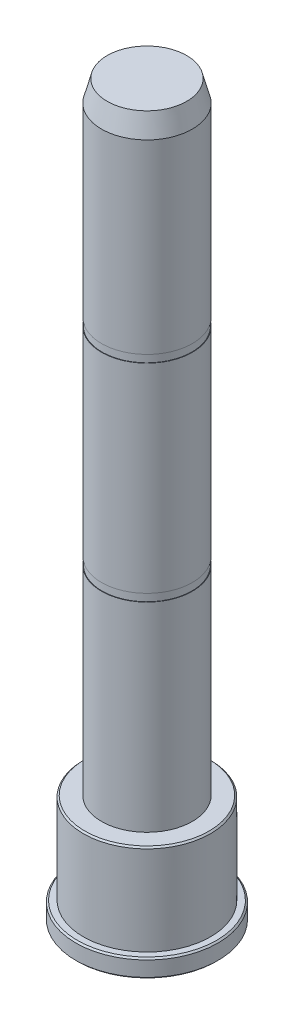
ISO-10303-21;
HEADER;
FILE_DESCRIPTION(('STEP AP214'),'2;1');
FILE_NAME('part.step','',(''),(''),'','','');
FILE_SCHEMA(('AUTOMOTIVE_DESIGN { 1 0 10303 214 1 1 1 1 }'));
ENDSEC;
DATA;
#1=APPLICATION_CONTEXT('core data for automotive mechanical design processes');
#2=APPLICATION_PROTOCOL_DEFINITION('international standard','automotive_design',2000,#1);
#3=PRODUCT_CONTEXT('',#1,'mechanical');
#4=PRODUCT('Part','Part','',(#3));
#5=PRODUCT_RELATED_PRODUCT_CATEGORY('part','',(#4));
#6=PRODUCT_DEFINITION_FORMATION('','',#4);
#7=PRODUCT_DEFINITION_CONTEXT('part definition',#1,'design');
#8=PRODUCT_DEFINITION('design','',#6,#7);
#9=PRODUCT_DEFINITION_SHAPE('','',#8);
#10=(LENGTH_UNIT() NAMED_UNIT(*) SI_UNIT(.MILLI.,.METRE.));
#11=(NAMED_UNIT(*) PLANE_ANGLE_UNIT() SI_UNIT($,.RADIAN.));
#12=(NAMED_UNIT(*) SI_UNIT($,.STERADIAN.) SOLID_ANGLE_UNIT());
#13=UNCERTAINTY_MEASURE_WITH_UNIT(LENGTH_MEASURE(1.E-05),#10,'distance_accuracy_value','');
#14=(GEOMETRIC_REPRESENTATION_CONTEXT(3) GLOBAL_UNCERTAINTY_ASSIGNED_CONTEXT((#13)) GLOBAL_UNIT_ASSIGNED_CONTEXT((#10,
#11,#12)) REPRESENTATION_CONTEXT('',''));
#15=CARTESIAN_POINT('',(0.,0.,0.));
#16=DIRECTION('',(0.,0.,1.));
#17=DIRECTION('',(1.,0.,0.));
#18=AXIS2_PLACEMENT_3D('',#15,#16,#17);
#19=CARTESIAN_POINT('',(0.,-6.,0.));
#20=DIRECTION('',(0.,1.,0.));
#21=DIRECTION('',(-1.,0.,0.));
#22=AXIS2_PLACEMENT_3D('',#19,#20,#21);
#23=PLANE('',#22);
#24=CARTESIAN_POINT('',(0.,-6.,0.));
#25=DIRECTION('',(0.,1.,0.));
#26=DIRECTION('',(-1.,0.,0.));
#27=AXIS2_PLACEMENT_3D('',#24,#25,#26);
#28=CIRCLE('',#27,23.);
#29=CARTESIAN_POINT('',(-23.,-6.,0.));
#30=VERTEX_POINT('',#29);
#31=EDGE_CURVE('E8',#30,#30,#28,.F.);
#32=ORIENTED_EDGE('',*,*,#31,.T.);
#33=EDGE_LOOP('',(#32));
#34=FACE_BOUND('',#33,.T.);
#35=ADVANCED_FACE('F13',(#34),#23,.F.);
#36=CARTESIAN_POINT('',(0.,235.,0.));
#37=DIRECTION('',(0.,1.,0.));
#38=DIRECTION('',(-1.,0.,0.));
#39=AXIS2_PLACEMENT_3D('',#36,#37,#38);
#40=CYLINDRICAL_SURFACE('',#39,23.5);
#41=CARTESIAN_POINT('',(0.,-0.499999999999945,0.));
#42=DIRECTION('',(0.,-1.,0.));
#43=DIRECTION('',(1.,0.,0.));
#44=AXIS2_PLACEMENT_3D('',#41,#42,#43);
#45=CIRCLE('',#44,23.5);
#46=CARTESIAN_POINT('',(23.5,-0.499999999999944,0.));
#47=VERTEX_POINT('',#46);
#48=EDGE_CURVE('E21',#47,#47,#45,.T.);
#49=ORIENTED_EDGE('',*,*,#48,.T.);
#50=EDGE_LOOP('',(#49));
#51=FACE_BOUND('',#50,.T.);
#52=CARTESIAN_POINT('',(0.,-5.5,0.));
#53=DIRECTION('',(0.,1.,0.));
#54=DIRECTION('',(-1.,0.,0.));
#55=AXIS2_PLACEMENT_3D('',#52,#53,#54);
#56=CIRCLE('',#55,23.5);
#57=CARTESIAN_POINT('',(-23.5,-5.5,0.));
#58=VERTEX_POINT('',#57);
#59=EDGE_CURVE('E29',#58,#58,#56,.T.);
#60=ORIENTED_EDGE('',*,*,#59,.T.);
#61=EDGE_LOOP('',(#60));
#62=FACE_BOUND('',#61,.T.);
#63=ADVANCED_FACE('F112',(#51,#62),#40,.T.);
#64=CARTESIAN_POINT('',(-23.5,0.,0.));
#65=DIRECTION('',(0.,-1.,0.));
#66=DIRECTION('',(1.,0.,0.));
#67=AXIS2_PLACEMENT_3D('',#64,#65,#66);
#68=PLANE('',#67);
#69=CARTESIAN_POINT('',(0.,0.,0.));
#70=DIRECTION('',(0.,-1.,0.));
#71=DIRECTION('',(1.,0.,0.));
#72=AXIS2_PLACEMENT_3D('',#69,#70,#71);
#73=CIRCLE('',#72,23.);
#74=CARTESIAN_POINT('',(23.,0.,0.));
#75=VERTEX_POINT('',#74);
#76=EDGE_CURVE('E35',#75,#75,#73,.F.);
#77=ORIENTED_EDGE('',*,*,#76,.T.);
#78=EDGE_LOOP('',(#77));
#79=FACE_BOUND('',#78,.T.);
#80=CARTESIAN_POINT('',(0.,0.,0.));
#81=DIRECTION('',(0.,1.,0.));
#82=DIRECTION('',(-1.,0.,0.));
#83=AXIS2_PLACEMENT_3D('',#80,#81,#82);
#84=CIRCLE('',#83,21.);
#85=CARTESIAN_POINT('',(-21.,0.,0.));
#86=VERTEX_POINT('',#85);
#87=EDGE_CURVE('E47',#86,#86,#84,.T.);
#88=ORIENTED_EDGE('',*,*,#87,.F.);
#89=EDGE_LOOP('',(#88));
#90=FACE_BOUND('',#89,.T.);
#91=ADVANCED_FACE('F116',(#79,#90),#68,.F.);
#92=CARTESIAN_POINT('',(0.,235.,0.));
#93=DIRECTION('',(0.,1.,0.));
#94=DIRECTION('',(-1.,0.,0.));
#95=AXIS2_PLACEMENT_3D('',#92,#93,#94);
#96=CYLINDRICAL_SURFACE('',#95,21.);
#97=CARTESIAN_POINT('',(0.,29.5,0.));
#98=DIRECTION('',(0.,-1.,0.));
#99=DIRECTION('',(1.,0.,0.));
#100=AXIS2_PLACEMENT_3D('',#97,#98,#99);
#101=CIRCLE('',#100,21.);
#102=CARTESIAN_POINT('',(21.,29.5,0.));
#103=VERTEX_POINT('',#102);
#104=EDGE_CURVE('E40',#103,#103,#101,.T.);
#105=ORIENTED_EDGE('',*,*,#104,.T.);
#106=EDGE_LOOP('',(#105));
#107=FACE_BOUND('',#106,.T.);
#108=ORIENTED_EDGE('',*,*,#87,.T.);
#109=EDGE_LOOP('',(#108));
#110=FACE_BOUND('',#109,.T.);
#111=ADVANCED_FACE('F133',(#107,#110),#96,.T.);
#112=CARTESIAN_POINT('',(-21.,30.,0.));
#113=DIRECTION('',(0.,-1.,0.));
#114=DIRECTION('',(1.,0.,0.));
#115=AXIS2_PLACEMENT_3D('',#112,#113,#114);
#116=PLANE('',#115);
#117=CARTESIAN_POINT('',(0.,30.,0.));
#118=DIRECTION('',(0.,-1.,0.));
#119=DIRECTION('',(1.,0.,0.));
#120=AXIS2_PLACEMENT_3D('',#117,#118,#119);
#121=CIRCLE('',#120,20.5);
#122=CARTESIAN_POINT('',(20.5,30.,0.));
#123=VERTEX_POINT('',#122);
#124=EDGE_CURVE('E43',#123,#123,#121,.F.);
#125=ORIENTED_EDGE('',*,*,#124,.T.);
#126=EDGE_LOOP('',(#125));
#127=FACE_BOUND('',#126,.T.);
#128=CARTESIAN_POINT('',(0.,30.,0.));
#129=DIRECTION('',(0.,1.,0.));
#130=DIRECTION('',(-1.,0.,0.));
#131=AXIS2_PLACEMENT_3D('',#128,#129,#130);
#132=CIRCLE('',#131,15.);
#133=CARTESIAN_POINT('',(-15.,30.,0.));
#134=VERTEX_POINT('',#133);
#135=EDGE_CURVE('E51',#134,#134,#132,.T.);
#136=ORIENTED_EDGE('',*,*,#135,.F.);
#137=EDGE_LOOP('',(#136));
#138=FACE_BOUND('',#137,.T.);
#139=ADVANCED_FACE('F137',(#127,#138),#116,.F.);
#140=CARTESIAN_POINT('',(0.,235.,0.));
#141=DIRECTION('',(0.,1.,0.));
#142=DIRECTION('',(-1.,0.,0.));
#143=AXIS2_PLACEMENT_3D('',#140,#141,#142);
#144=CYLINDRICAL_SURFACE('',#143,15.);
#145=CARTESIAN_POINT('',(0.,95.8333333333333,0.));
#146=DIRECTION('',(0.,1.,0.));
#147=DIRECTION('',(-1.,0.,0.));
#148=AXIS2_PLACEMENT_3D('',#145,#146,#147);
#149=CIRCLE('',#148,15.);
#150=CARTESIAN_POINT('',(-15.,95.8333333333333,0.));
#151=VERTEX_POINT('',#150);
#152=EDGE_CURVE('E55',#151,#151,#149,.T.);
#153=ORIENTED_EDGE('',*,*,#152,.F.);
#154=EDGE_LOOP('',(#153));
#155=FACE_BOUND('',#154,.T.);
#156=ORIENTED_EDGE('',*,*,#135,.T.);
#157=EDGE_LOOP('',(#156));
#158=FACE_BOUND('',#157,.T.);
#159=ADVANCED_FACE('F142',(#155,#158),#144,.T.);
#160=CARTESIAN_POINT('',(-15.,95.8333333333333,0.));
#161=DIRECTION('',(0.,-1.,0.));
#162=DIRECTION('',(1.,0.,0.));
#163=AXIS2_PLACEMENT_3D('',#160,#161,#162);
#164=PLANE('',#163);
#165=CARTESIAN_POINT('',(0.,95.8333333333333,0.));
#166=DIRECTION('',(0.,1.,0.));
#167=DIRECTION('',(-1.,0.,0.));
#168=AXIS2_PLACEMENT_3D('',#165,#166,#167);
#169=CIRCLE('',#168,14.85);
#170=CARTESIAN_POINT('',(-14.85,95.8333333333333,0.));
#171=VERTEX_POINT('',#170);
#172=EDGE_CURVE('E59',#171,#171,#169,.T.);
#173=ORIENTED_EDGE('',*,*,#172,.F.);
#174=EDGE_LOOP('',(#173));
#175=FACE_BOUND('',#174,.T.);
#176=ORIENTED_EDGE('',*,*,#152,.T.);
#177=EDGE_LOOP('',(#176));
#178=FACE_BOUND('',#177,.T.);
#179=ADVANCED_FACE('F148',(#175,#178),#164,.F.);
#180=CARTESIAN_POINT('',(0.,235.,0.));
#181=DIRECTION('',(0.,1.,0.));
#182=DIRECTION('',(-1.,0.,0.));
#183=AXIS2_PLACEMENT_3D('',#180,#181,#182);
#184=CYLINDRICAL_SURFACE('',#183,14.85);
#185=CARTESIAN_POINT('',(0.,98.3333333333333,0.));
#186=DIRECTION('',(0.,1.,0.));
#187=DIRECTION('',(-1.,0.,0.));
#188=AXIS2_PLACEMENT_3D('',#185,#186,#187);
#189=CIRCLE('',#188,14.85);
#190=CARTESIAN_POINT('',(-14.85,98.3333333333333,0.));
#191=VERTEX_POINT('',#190);
#192=EDGE_CURVE('E63',#191,#191,#189,.T.);
#193=ORIENTED_EDGE('',*,*,#192,.F.);
#194=EDGE_LOOP('',(#193));
#195=FACE_BOUND('',#194,.T.);
#196=ORIENTED_EDGE('',*,*,#172,.T.);
#197=EDGE_LOOP('',(#196));
#198=FACE_BOUND('',#197,.T.);
#199=ADVANCED_FACE('F152',(#195,#198),#184,.T.);
#200=CARTESIAN_POINT('',(-14.85,98.3333333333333,0.));
#201=DIRECTION('',(0.,1.,0.));
#202=DIRECTION('',(-1.,0.,0.));
#203=AXIS2_PLACEMENT_3D('',#200,#201,#202);
#204=PLANE('',#203);
#205=CARTESIAN_POINT('',(0.,98.3333333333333,0.));
#206=DIRECTION('',(0.,1.,0.));
#207=DIRECTION('',(-1.,0.,0.));
#208=AXIS2_PLACEMENT_3D('',#205,#206,#207);
#209=CIRCLE('',#208,15.);
#210=CARTESIAN_POINT('',(-15.,98.3333333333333,0.));
#211=VERTEX_POINT('',#210);
#212=EDGE_CURVE('E67',#211,#211,#209,.T.);
#213=ORIENTED_EDGE('',*,*,#212,.F.);
#214=EDGE_LOOP('',(#213));
#215=FACE_BOUND('',#214,.T.);
#216=ORIENTED_EDGE('',*,*,#192,.T.);
#217=EDGE_LOOP('',(#216));
#218=FACE_BOUND('',#217,.T.);
#219=ADVANCED_FACE('F156',(#215,#218),#204,.F.);
#220=CARTESIAN_POINT('',(0.,235.,0.));
#221=DIRECTION('',(0.,1.,0.));
#222=DIRECTION('',(-1.,0.,0.));
#223=AXIS2_PLACEMENT_3D('',#220,#221,#222);
#224=CYLINDRICAL_SURFACE('',#223,15.);
#225=CARTESIAN_POINT('',(0.,164.166666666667,0.));
#226=DIRECTION('',(0.,1.,0.));
#227=DIRECTION('',(-1.,0.,0.));
#228=AXIS2_PLACEMENT_3D('',#225,#226,#227);
#229=CIRCLE('',#228,15.);
#230=CARTESIAN_POINT('',(-15.,164.166666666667,0.));
#231=VERTEX_POINT('',#230);
#232=EDGE_CURVE('E71',#231,#231,#229,.T.);
#233=ORIENTED_EDGE('',*,*,#232,.F.);
#234=EDGE_LOOP('',(#233));
#235=FACE_BOUND('',#234,.T.);
#236=ORIENTED_EDGE('',*,*,#212,.T.);
#237=EDGE_LOOP('',(#236));
#238=FACE_BOUND('',#237,.T.);
#239=ADVANCED_FACE('F160',(#235,#238),#224,.T.);
#240=CARTESIAN_POINT('',(-15.,164.166666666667,0.));
#241=DIRECTION('',(0.,-1.,0.));
#242=DIRECTION('',(1.,0.,0.));
#243=AXIS2_PLACEMENT_3D('',#240,#241,#242);
#244=PLANE('',#243);
#245=CARTESIAN_POINT('',(0.,164.166666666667,0.));
#246=DIRECTION('',(0.,1.,0.));
#247=DIRECTION('',(-1.,0.,0.));
#248=AXIS2_PLACEMENT_3D('',#245,#246,#247);
#249=CIRCLE('',#248,14.85);
#250=CARTESIAN_POINT('',(-14.85,164.166666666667,0.));
#251=VERTEX_POINT('',#250);
#252=EDGE_CURVE('E75',#251,#251,#249,.T.);
#253=ORIENTED_EDGE('',*,*,#252,.F.);
#254=EDGE_LOOP('',(#253));
#255=FACE_BOUND('',#254,.T.);
#256=ORIENTED_EDGE('',*,*,#232,.T.);
#257=EDGE_LOOP('',(#256));
#258=FACE_BOUND('',#257,.T.);
#259=ADVANCED_FACE('F164',(#255,#258),#244,.F.);
#260=CARTESIAN_POINT('',(0.,235.,0.));
#261=DIRECTION('',(0.,1.,0.));
#262=DIRECTION('',(-1.,0.,0.));
#263=AXIS2_PLACEMENT_3D('',#260,#261,#262);
#264=CYLINDRICAL_SURFACE('',#263,14.85);
#265=CARTESIAN_POINT('',(0.,166.666666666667,0.));
#266=DIRECTION('',(0.,1.,0.));
#267=DIRECTION('',(-1.,0.,0.));
#268=AXIS2_PLACEMENT_3D('',#265,#266,#267);
#269=CIRCLE('',#268,14.85);
#270=CARTESIAN_POINT('',(-14.85,166.666666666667,0.));
#271=VERTEX_POINT('',#270);
#272=EDGE_CURVE('E79',#271,#271,#269,.T.);
#273=ORIENTED_EDGE('',*,*,#272,.F.);
#274=EDGE_LOOP('',(#273));
#275=FACE_BOUND('',#274,.T.);
#276=ORIENTED_EDGE('',*,*,#252,.T.);
#277=EDGE_LOOP('',(#276));
#278=FACE_BOUND('',#277,.T.);
#279=ADVANCED_FACE('F168',(#275,#278),#264,.T.);
#280=CARTESIAN_POINT('',(-14.85,166.666666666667,0.));
#281=DIRECTION('',(0.,1.,0.));
#282=DIRECTION('',(-1.,0.,0.));
#283=AXIS2_PLACEMENT_3D('',#280,#281,#282);
#284=PLANE('',#283);
#285=CARTESIAN_POINT('',(0.,166.666666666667,0.));
#286=DIRECTION('',(0.,1.,0.));
#287=DIRECTION('',(-1.,0.,0.));
#288=AXIS2_PLACEMENT_3D('',#285,#286,#287);
#289=CIRCLE('',#288,15.);
#290=CARTESIAN_POINT('',(-15.,166.666666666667,0.));
#291=VERTEX_POINT('',#290);
#292=EDGE_CURVE('E83',#291,#291,#289,.T.);
#293=ORIENTED_EDGE('',*,*,#292,.F.);
#294=EDGE_LOOP('',(#293));
#295=FACE_BOUND('',#294,.T.);
#296=ORIENTED_EDGE('',*,*,#272,.T.);
#297=EDGE_LOOP('',(#296));
#298=FACE_BOUND('',#297,.T.);
#299=ADVANCED_FACE('F108',(#295,#298),#284,.F.);
#300=CARTESIAN_POINT('',(0.,235.,0.));
#301=DIRECTION('',(0.,1.,0.));
#302=DIRECTION('',(-1.,0.,0.));
#303=AXIS2_PLACEMENT_3D('',#300,#301,#302);
#304=CYLINDRICAL_SURFACE('',#303,15.);
#305=CARTESIAN_POINT('',(0.,228.,0.));
#306=DIRECTION('',(0.,1.,0.));
#307=DIRECTION('',(-1.,0.,0.));
#308=AXIS2_PLACEMENT_3D('',#305,#306,#307);
#309=CIRCLE('',#308,15.);
#310=CARTESIAN_POINT('',(-15.,228.,0.));
#311=VERTEX_POINT('',#310);
#312=EDGE_CURVE('E87',#311,#311,#309,.T.);
#313=ORIENTED_EDGE('',*,*,#312,.F.);
#314=EDGE_LOOP('',(#313));
#315=FACE_BOUND('',#314,.T.);
#316=ORIENTED_EDGE('',*,*,#292,.T.);
#317=EDGE_LOOP('',(#316));
#318=FACE_BOUND('',#317,.T.);
#319=ADVANCED_FACE('F99',(#315,#318),#304,.T.);
#320=CARTESIAN_POINT('',(0.,235.,0.));
#321=DIRECTION('',(0.,-1.,0.));
#322=DIRECTION('',(1.,0.,0.));
#323=AXIS2_PLACEMENT_3D('',#320,#321,#322);
#324=CONICAL_SURFACE('',#323,13.1243556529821,0.261799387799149);
#325=ORIENTED_EDGE('',*,*,#312,.T.);
#326=EDGE_LOOP('',(#325));
#327=FACE_BOUND('',#326,.T.);
#328=CARTESIAN_POINT('',(0.,235.,0.));
#329=DIRECTION('',(0.,1.,0.));
#330=DIRECTION('',(-1.,0.,0.));
#331=AXIS2_PLACEMENT_3D('',#328,#329,#330);
#332=CIRCLE('',#331,13.1243556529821);
#333=CARTESIAN_POINT('',(-13.1243556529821,235.,0.));
#334=VERTEX_POINT('',#333);
#335=EDGE_CURVE('E91',#334,#334,#332,.T.);
#336=ORIENTED_EDGE('',*,*,#335,.F.);
#337=EDGE_LOOP('',(#336));
#338=FACE_BOUND('',#337,.T.);
#339=ADVANCED_FACE('F97',(#327,#338),#324,.T.);
#340=CARTESIAN_POINT('',(-13.1243556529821,235.,0.));
#341=DIRECTION('',(0.,-1.,0.));
#342=DIRECTION('',(1.,0.,0.));
#343=AXIS2_PLACEMENT_3D('',#340,#341,#342);
#344=PLANE('',#343);
#345=ORIENTED_EDGE('',*,*,#335,.T.);
#346=EDGE_LOOP('',(#345));
#347=FACE_BOUND('',#346,.T.);
#348=ADVANCED_FACE('F95',(#347),#344,.F.);
#349=CARTESIAN_POINT('',(0.,30.,0.));
#350=DIRECTION('',(0.,-1.,0.));
#351=DIRECTION('',(1.,0.,0.));
#352=AXIS2_PLACEMENT_3D('',#349,#350,#351);
#353=CONICAL_SURFACE('',#352,20.5,0.785398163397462);
#354=ORIENTED_EDGE('',*,*,#104,.F.);
#355=EDGE_LOOP('',(#354));
#356=FACE_BOUND('',#355,.T.);
#357=ORIENTED_EDGE('',*,*,#124,.F.);
#358=EDGE_LOOP('',(#357));
#359=FACE_BOUND('',#358,.T.);
#360=ADVANCED_FACE('F106',(#356,#359),#353,.T.);
#361=CARTESIAN_POINT('',(0.,0.,0.));
#362=DIRECTION('',(0.,-1.,0.));
#363=DIRECTION('',(1.,0.,0.));
#364=AXIS2_PLACEMENT_3D('',#361,#362,#363);
#365=CONICAL_SURFACE('',#364,23.,0.785398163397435);
#366=ORIENTED_EDGE('',*,*,#48,.F.);
#367=EDGE_LOOP('',(#366));
#368=FACE_BOUND('',#367,.T.);
#369=ORIENTED_EDGE('',*,*,#76,.F.);
#370=EDGE_LOOP('',(#369));
#371=FACE_BOUND('',#370,.T.);
#372=ADVANCED_FACE('F121',(#368,#371),#365,.T.);
#373=CARTESIAN_POINT('',(0.,-5.5,0.));
#374=DIRECTION('',(0.,1.,0.));
#375=DIRECTION('',(-1.,0.,0.));
#376=AXIS2_PLACEMENT_3D('',#373,#374,#375);
#377=CONICAL_SURFACE('',#376,23.5,0.785398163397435);
#378=ORIENTED_EDGE('',*,*,#31,.F.);
#379=EDGE_LOOP('',(#378));
#380=FACE_BOUND('',#379,.T.);
#381=ORIENTED_EDGE('',*,*,#59,.F.);
#382=EDGE_LOOP('',(#381));
#383=FACE_BOUND('',#382,.T.);
#384=ADVANCED_FACE('F15',(#380,#383),#377,.T.);
#385=CLOSED_SHELL('',(#35,#63,#91,#111,#139,#159,#179,#199,#219,#239,#259,#279,#299,#319,#339,
#348,#360,#372,#384));
#386=MANIFOLD_SOLID_BREP('B1',#385);
#387=ADVANCED_BREP_SHAPE_REPRESENTATION('',(#18,#386),#14);
#388=SHAPE_DEFINITION_REPRESENTATION(#9,#387);
ENDSEC;
END-ISO-10303-21;
